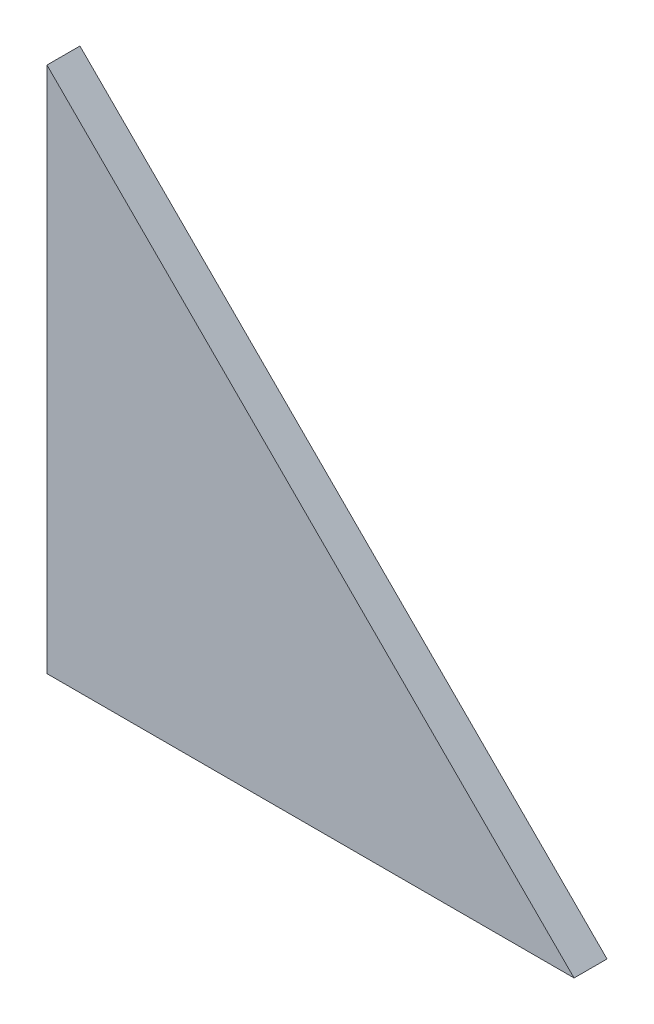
ISO-10303-21;
HEADER;
FILE_DESCRIPTION(('STEP AP214'),'2;1');
FILE_NAME('part.step','',(''),(''),'','','');
FILE_SCHEMA(('AUTOMOTIVE_DESIGN { 1 0 10303 214 1 1 1 1 }'));
ENDSEC;
DATA;
#1=APPLICATION_CONTEXT('core data for automotive mechanical design processes');
#2=APPLICATION_PROTOCOL_DEFINITION('international standard','automotive_design',2000,#1);
#3=PRODUCT_CONTEXT('',#1,'mechanical');
#4=PRODUCT('Part','Part','',(#3));
#5=PRODUCT_RELATED_PRODUCT_CATEGORY('part','',(#4));
#6=PRODUCT_DEFINITION_FORMATION('','',#4);
#7=PRODUCT_DEFINITION_CONTEXT('part definition',#1,'design');
#8=PRODUCT_DEFINITION('design','',#6,#7);
#9=PRODUCT_DEFINITION_SHAPE('','',#8);
#10=(LENGTH_UNIT() NAMED_UNIT(*) SI_UNIT(.MILLI.,.METRE.));
#11=(NAMED_UNIT(*) PLANE_ANGLE_UNIT() SI_UNIT($,.RADIAN.));
#12=(NAMED_UNIT(*) SI_UNIT($,.STERADIAN.) SOLID_ANGLE_UNIT());
#13=UNCERTAINTY_MEASURE_WITH_UNIT(LENGTH_MEASURE(1.E-05),#10,'distance_accuracy_value','');
#14=(GEOMETRIC_REPRESENTATION_CONTEXT(3) GLOBAL_UNCERTAINTY_ASSIGNED_CONTEXT((#13)) GLOBAL_UNIT_ASSIGNED_CONTEXT((#10,
#11,#12)) REPRESENTATION_CONTEXT('',''));
#15=CARTESIAN_POINT('',(0.,0.,0.));
#16=DIRECTION('',(0.,0.,1.));
#17=DIRECTION('',(1.,0.,0.));
#18=AXIS2_PLACEMENT_3D('',#15,#16,#17);
#19=CARTESIAN_POINT('',(0.,101.6,6.35));
#20=DIRECTION('',(1.,0.,0.));
#21=DIRECTION('',(0.,1.,0.));
#22=AXIS2_PLACEMENT_3D('',#19,#20,#21);
#23=PLANE('',#22);
#24=DIRECTION('',(0.,-1.,0.));
#25=VECTOR('',#24,1.);
#26=CARTESIAN_POINT('',(0.,101.6,0.));
#27=LINE('',#26,#25);
#28=CARTESIAN_POINT('',(0.,101.6,0.));
#29=VERTEX_POINT('',#28);
#30=CARTESIAN_POINT('',(0.,0.,0.));
#31=VERTEX_POINT('',#30);
#32=EDGE_CURVE('E79',#29,#31,#27,.T.);
#33=ORIENTED_EDGE('',*,*,#32,.T.);
#34=DIRECTION('',(0.,0.,-1.));
#35=VECTOR('',#34,1.);
#36=CARTESIAN_POINT('',(0.,0.,6.35));
#37=LINE('',#36,#35);
#38=CARTESIAN_POINT('',(0.,0.,6.35));
#39=VERTEX_POINT('',#38);
#40=EDGE_CURVE('E11',#39,#31,#37,.T.);
#41=ORIENTED_EDGE('',*,*,#40,.F.);
#42=DIRECTION('',(0.,-1.,0.));
#43=VECTOR('',#42,1.);
#44=CARTESIAN_POINT('',(0.,101.6,6.35));
#45=LINE('',#44,#43);
#46=CARTESIAN_POINT('',(0.,101.6,6.35));
#47=VERTEX_POINT('',#46);
#48=EDGE_CURVE('E72',#47,#39,#45,.T.);
#49=ORIENTED_EDGE('',*,*,#48,.F.);
#50=DIRECTION('',(0.,0.,-1.));
#51=VECTOR('',#50,1.);
#52=CARTESIAN_POINT('',(0.,101.6,6.35));
#53=LINE('',#52,#51);
#54=EDGE_CURVE('E80',#47,#29,#53,.T.);
#55=ORIENTED_EDGE('',*,*,#54,.T.);
#56=EDGE_LOOP('',(#33,#41,#49,#55));
#57=FACE_BOUND('',#56,.T.);
#58=ADVANCED_FACE('F32',(#57),#23,.F.);
#59=CARTESIAN_POINT('',(0.,0.,6.35));
#60=DIRECTION('',(0.,1.,0.));
#61=DIRECTION('',(0.,0.,1.));
#62=AXIS2_PLACEMENT_3D('',#59,#60,#61);
#63=PLANE('',#62);
#64=DIRECTION('',(1.,0.,0.));
#65=VECTOR('',#64,1.);
#66=CARTESIAN_POINT('',(0.,0.,0.));
#67=LINE('',#66,#65);
#68=CARTESIAN_POINT('',(101.600000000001,0.,0.));
#69=VERTEX_POINT('',#68);
#70=EDGE_CURVE('E60',#31,#69,#67,.T.);
#71=ORIENTED_EDGE('',*,*,#70,.T.);
#72=DIRECTION('',(0.,0.,-1.));
#73=VECTOR('',#72,1.);
#74=CARTESIAN_POINT('',(101.600000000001,0.,6.35));
#75=LINE('',#74,#73);
#76=CARTESIAN_POINT('',(101.600000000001,0.,6.35));
#77=VERTEX_POINT('',#76);
#78=EDGE_CURVE('E40',#77,#69,#75,.T.);
#79=ORIENTED_EDGE('',*,*,#78,.F.);
#80=DIRECTION('',(1.,0.,0.));
#81=VECTOR('',#80,1.);
#82=CARTESIAN_POINT('',(0.,0.,6.35));
#83=LINE('',#82,#81);
#84=EDGE_CURVE('E68',#39,#77,#83,.T.);
#85=ORIENTED_EDGE('',*,*,#84,.F.);
#86=ORIENTED_EDGE('',*,*,#40,.T.);
#87=EDGE_LOOP('',(#71,#79,#85,#86));
#88=FACE_BOUND('',#87,.T.);
#89=ADVANCED_FACE('F69',(#88),#63,.F.);
#90=CARTESIAN_POINT('',(101.600000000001,0.,6.35));
#91=DIRECTION('',(-0.707106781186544,-0.707106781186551,0.));
#92=DIRECTION('',(0.707106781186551,-0.707106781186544,0.));
#93=AXIS2_PLACEMENT_3D('',#90,#91,#92);
#94=PLANE('',#93);
#95=DIRECTION('',(-0.707106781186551,0.707106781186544,0.));
#96=VECTOR('',#95,1.);
#97=CARTESIAN_POINT('',(101.600000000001,0.,0.));
#98=LINE('',#97,#96);
#99=EDGE_CURVE('E65',#69,#29,#98,.T.);
#100=ORIENTED_EDGE('',*,*,#99,.T.);
#101=ORIENTED_EDGE('',*,*,#54,.F.);
#102=DIRECTION('',(-0.707106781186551,0.707106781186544,0.));
#103=VECTOR('',#102,1.);
#104=CARTESIAN_POINT('',(101.600000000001,0.,6.35));
#105=LINE('',#104,#103);
#106=EDGE_CURVE('E48',#77,#47,#105,.T.);
#107=ORIENTED_EDGE('',*,*,#106,.F.);
#108=ORIENTED_EDGE('',*,*,#78,.T.);
#109=EDGE_LOOP('',(#100,#101,#107,#108));
#110=FACE_BOUND('',#109,.T.);
#111=ADVANCED_FACE('F87',(#110),#94,.F.);
#112=CARTESIAN_POINT('',(0.,0.,6.35));
#113=DIRECTION('',(0.,0.,1.));
#114=DIRECTION('',(1.,0.,0.));
#115=AXIS2_PLACEMENT_3D('',#112,#113,#114);
#116=PLANE('',#115);
#117=ORIENTED_EDGE('',*,*,#48,.T.);
#118=ORIENTED_EDGE('',*,*,#84,.T.);
#119=ORIENTED_EDGE('',*,*,#106,.T.);
#120=EDGE_LOOP('',(#117,#118,#119));
#121=FACE_BOUND('',#120,.T.);
#122=ADVANCED_FACE('F75',(#121),#116,.T.);
#123=CARTESIAN_POINT('',(0.,0.,0.));
#124=DIRECTION('',(0.,0.,1.));
#125=DIRECTION('',(1.,0.,0.));
#126=AXIS2_PLACEMENT_3D('',#123,#124,#125);
#127=PLANE('',#126);
#128=ORIENTED_EDGE('',*,*,#32,.F.);
#129=ORIENTED_EDGE('',*,*,#99,.F.);
#130=ORIENTED_EDGE('',*,*,#70,.F.);
#131=EDGE_LOOP('',(#128,#129,#130));
#132=FACE_BOUND('',#131,.T.);
#133=ADVANCED_FACE('F88',(#132),#127,.F.);
#134=CLOSED_SHELL('',(#58,#89,#111,#122,#133));
#135=MANIFOLD_SOLID_BREP('B2',#134);
#136=ADVANCED_BREP_SHAPE_REPRESENTATION('',(#18,#135),#14);
#137=SHAPE_DEFINITION_REPRESENTATION(#9,#136);
ENDSEC;
END-ISO-10303-21;
